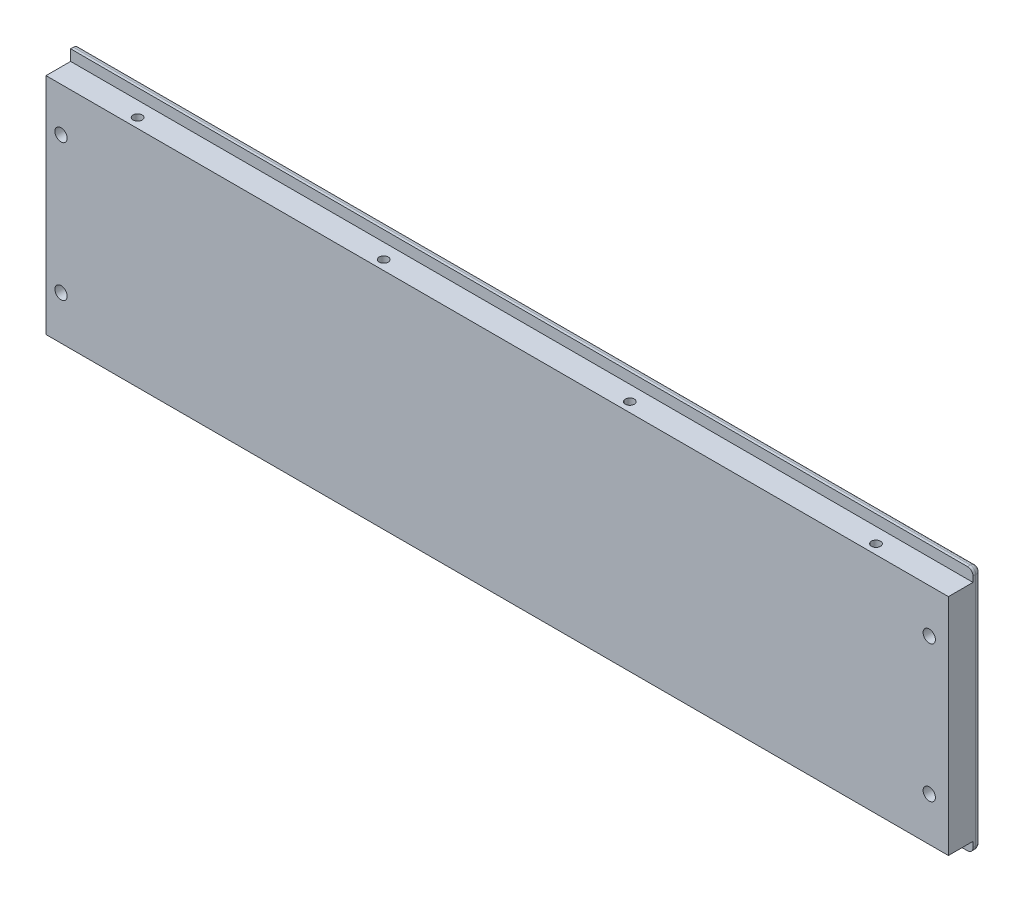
from build123d import *

# Parameters (mm, degrees)
SKETCH_1_W                     = 330
SKETCH_1_H                     = 90
EXTRUDE_1_DEPTH                = 12
SKETCH_2_W                     = 9
SKETCH_2_H                     = 4
CUT_EXTRUDE_1_DEPTH            = 343.263056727
FILLET_1_R                     = 2
FILLET_2_R                     = 2
HOLE_WIZARD_M4_1_D             = 3.3
HOLE_WIZARD_M4_1_2_D           = 4.5
HOLE_WIZARD_M4_1_2_CSINK_D     = 9.4
HOLE_WIZARD_M4_1_2_CSINK_ANGLE = 90


with BuildPart() as part:
    # Sketch 1 → Extrude 1 (new body)
    with BuildSketch(Plane.XY):
        with Locations((165, 45)):
            Rectangle(SKETCH_1_W, SKETCH_1_H)
    extrude(amount=EXTRUDE_1_DEPTH)

    # Sketch 2 → Cut-Extrude 1 (cut, through all)
    with BuildSketch(Plane.ZY):
        with Locations((7.5, 88)):
            Rectangle(SKETCH_2_W, SKETCH_2_H)
        with Locations((7.5, 2)):
            Rectangle(SKETCH_2_W, SKETCH_2_H)
    extrude(amount=-CUT_EXTRUDE_1_DEPTH, mode=Mode.SUBTRACT)

    # Fillet 1
    fillet_1_edges = [part.edges().sort_by_distance(p)[0] for p in [
        (165, 90, 0),
        (165, 0, 0),
    ]]
    fillet(fillet_1_edges, radius=FILLET_1_R)

    # Fillet 2
    fillet_2_edges = [part.edges().sort_by_distance(p)[0] for p in [
        (330, 90, 2.5),
        (330, 0, 2.5),
        (330, 45, 0),
        (330, 89.414213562, 0.585786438),
        (330, 0.585786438, 0.585786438),
    ]]
    fillet(fillet_2_edges, radius=FILLET_2_R)

    # Hole Wizard M4 _1 (through all)
    with Locations(Plane(origin=(0, 86, 0), x_dir=(1, 0, 0), z_dir=(0, 1, 0))):
        with Locations((30, -8.5), (120, -8.5), (210, -8.5), (300, -8.5)):
            Hole(HOLE_WIZARD_M4_1_D / 2)

    # Hole Wizard M4 _1 2 (through all)
    with Locations(Plane(origin=(0, 0, 0), x_dir=(-1, 0, 0), z_dir=(0, 0, -1))):
        with Locations((-323, 20), (-323, 70), (-5.5, 20), (-5.5, 70)):
            CounterSinkHole(HOLE_WIZARD_M4_1_2_D / 2, HOLE_WIZARD_M4_1_2_CSINK_D / 2, counter_sink_angle=HOLE_WIZARD_M4_1_2_CSINK_ANGLE)


solid = part.part
